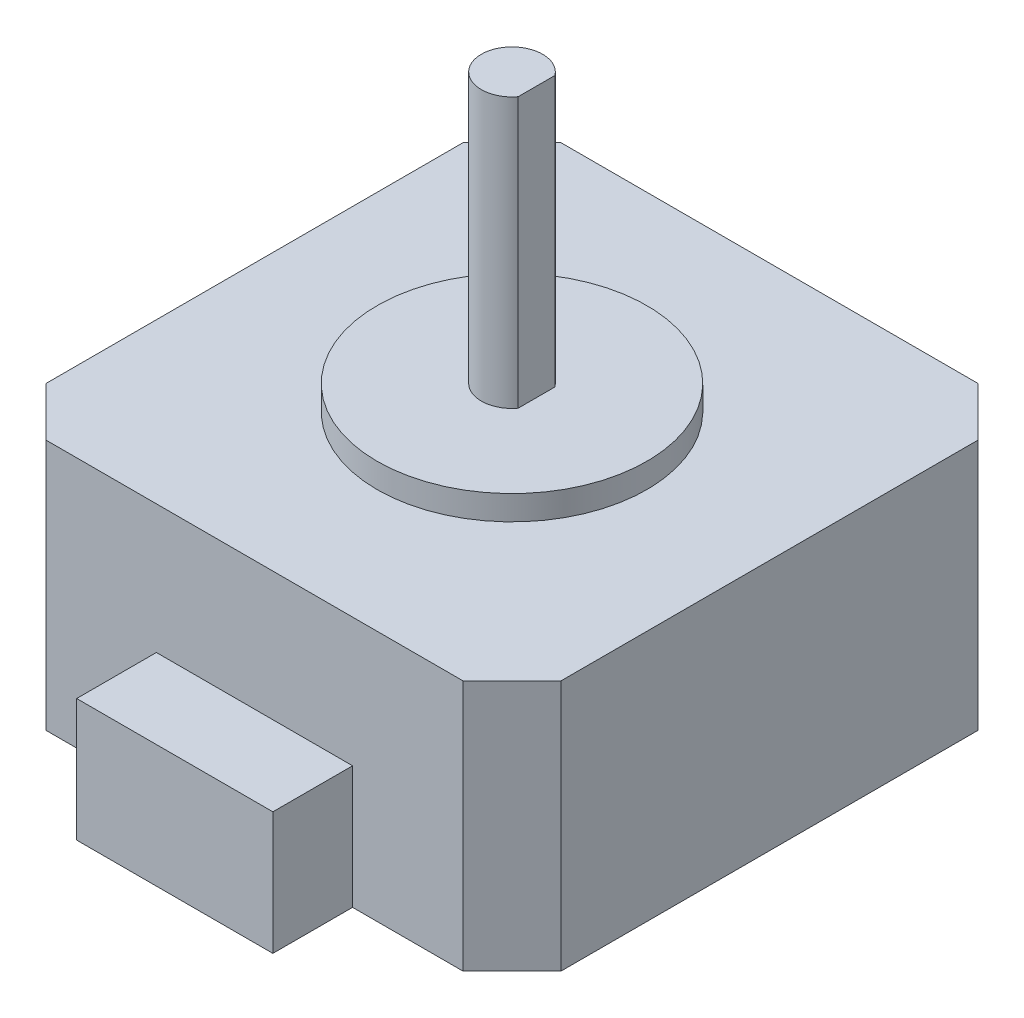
from build123d import *

# Parameters (mm, degrees)
BOSS_EXTRUDE1_DEPTH = 20.5
SKETCH2_R           = 11
BOSS_EXTRUDE2_DEPTH = 2
BOSS_EXTRUDE3_DEPTH = 22
SKETCH4_W           = 16
SKETCH4_H           = 6.5
BOSS_EXTRUDE4_DEPTH = 10


with BuildPart() as part:
    # Sketch1 → Boss-Extrude1 (new body)
    with BuildSketch(Plane(origin=(0, 0, 0), x_dir=(1, 0, 0), z_dir=(0, 1, 0))):
        Polygon((-17, 21), (-21, 17), (-21, -17), (-17, -21), (17, -21), (21, -17), (21, 17), (17, 21), align=None)
    extrude(amount=BOSS_EXTRUDE1_DEPTH)

    # Sketch2 → Boss-Extrude2 (add)
    with BuildSketch(Plane(origin=(0, 20.5, 0), x_dir=(1, 0, 0), z_dir=(0, 1, 0))):
        with Locations(Location((0, 0, 0), (0, 0, 270))):
            Circle(SKETCH2_R)
    extrude(amount=BOSS_EXTRUDE2_DEPTH)

    # Sketch3 → Boss-Extrude3 (add)
    with BuildSketch(Plane(origin=(0, 22.5, 0), x_dir=(1, 0, 0), z_dir=(0, 1, 0))):
        with BuildLine():
            Line((2, 1.5), (2, -1.5))
            ThreePointArc((2, -1.5), (-2.5, 0), (2, 1.5))
        make_face()
    extrude(amount=BOSS_EXTRUDE3_DEPTH)

    # Sketch4 → Boss-Extrude4 (add)
    with BuildSketch(Plane.XZ):
        with Locations((0, 24.25)):
            Rectangle(SKETCH4_W, SKETCH4_H)
    extrude(amount=-BOSS_EXTRUDE4_DEPTH)


solid = part.part
